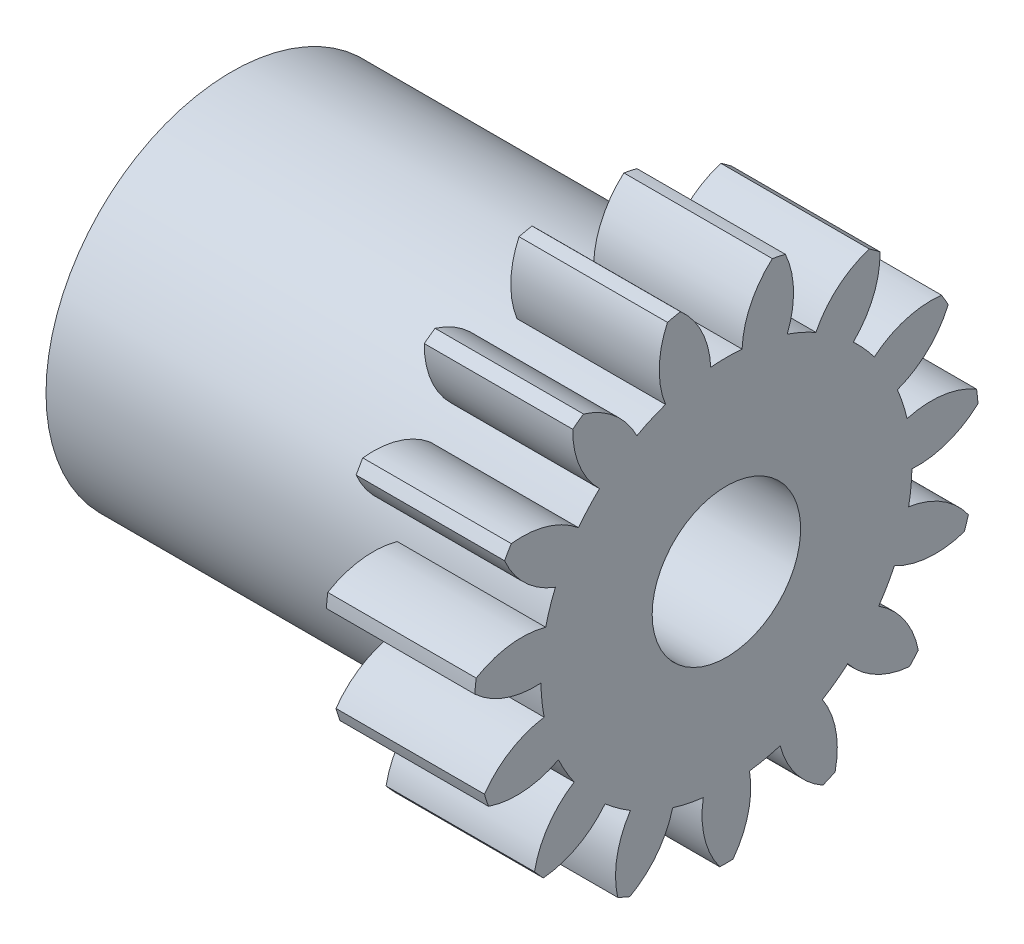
from build123d import *
from build123d.topology import SkipClean

# Parameters (mm, degrees)
BASPROSKE_W      = 15
BASPROSKE_H      = 25.5
TOOTHCUT_DEPTH   = 40.057649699
TEETHCUTS_COUNT  = 15
TEETHCUTS_ANGLE  = 336
HUBNEARONE_START = 35.0000508
HUBNEAONESKE_R   = 18.749
HUBNEARONE_DEPTH = 35.0000508
BORSKE_R         = 7.5
BORE_DEPTH       = 50.0000508


with BuildPart() as part:
    # BasProSke → Base-Revolve (revolve)
    with BuildSketch(Plane(origin=(0, 0, 0), x_dir=(1, 0, 0), z_dir=(0, 1, 0)), mode=Mode.PRIVATE) as base_revolve_sk:
        with Locations((7.5, 12.75)):
            Rectangle(BASPROSKE_W, BASPROSKE_H)
    revolve(base_revolve_sk.sketch.rotate(Axis((-10, 0, 0), (1, 0, 0)), 180), axis=Axis((-10, 0, 0), (1, 0, 0)))

    # TooCutSke → ToothCut (cut, through all)
    with BuildSketch(Plane(origin=(0, 0, 0), x_dir=(0, 0, -1), z_dir=(1, 0, 0))):
        with BuildLine():
            ThreePointArc((1.584594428, 18.681918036), (0, 18.749), (-1.584594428, 18.681918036))
            ThreePointArc((-1.584594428, 18.681918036), (-2.465052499, 22.206073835), (-4.666912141, 25.095138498))
            ThreePointArc((-4.666912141, 25.095138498), (0, 25.5254), (4.666912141, 25.095138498))
            ThreePointArc((4.666912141, 25.095138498), (2.465052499, 22.206073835), (1.584594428, 18.681918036))
        make_face()
    toothcut = extrude(amount=TOOTHCUT_DEPTH, mode=Mode.SUBTRACT)

    # TeethCuts: ToothCut ×15 about axis
    teethcuts_axis = Axis((-10, 0, 0), (1, 0, 0))
    for i in range(1, TEETHCUTS_COUNT):
        add(toothcut.rotate(teethcuts_axis, i * TEETHCUTS_ANGLE / (TEETHCUTS_COUNT - 1)), mode=Mode.SUBTRACT)

    # HubNeaOneSke → HubNearOne (add)
    with SkipClean():  # the faces are left unmerged after this step: merging them gives an invalid solid
        with BuildSketch(Plane.ZY.offset(HUBNEARONE_START)):
            Circle(HUBNEAONESKE_R)
        extrude(amount=-HUBNEARONE_DEPTH)

    # BorSke → Bore (cut, symmetric)
    with SkipClean():  # the faces are left unmerged after this step: merging them gives an invalid solid
        with BuildSketch(Plane(origin=(0, 0, 0), x_dir=(0, 0, -1), z_dir=(1, 0, 0))):
            with Locations(Location((0, 0, 0), (0, 0, 180))):
                Circle(BORSKE_R)
        extrude(amount=BORE_DEPTH, both=True, mode=Mode.SUBTRACT)


solid = part.part
